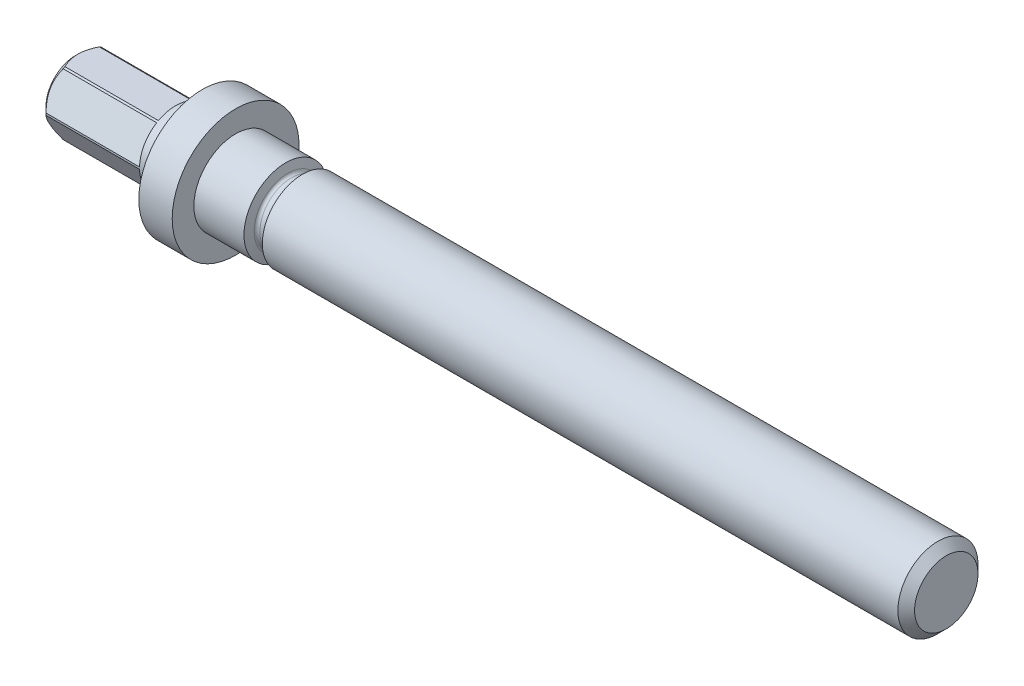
ISO-10303-21;
HEADER;
FILE_DESCRIPTION(('STEP AP214'),'2;1');
FILE_NAME('part.step','',(''),(''),'','','');
FILE_SCHEMA(('AUTOMOTIVE_DESIGN { 1 0 10303 214 1 1 1 1 }'));
ENDSEC;
DATA;
#1=APPLICATION_CONTEXT('core data for automotive mechanical design processes');
#2=APPLICATION_PROTOCOL_DEFINITION('international standard','automotive_design',2000,#1);
#3=PRODUCT_CONTEXT('',#1,'mechanical');
#4=PRODUCT('Part','Part','',(#3));
#5=PRODUCT_RELATED_PRODUCT_CATEGORY('part','',(#4));
#6=PRODUCT_DEFINITION_FORMATION('','',#4);
#7=PRODUCT_DEFINITION_CONTEXT('part definition',#1,'design');
#8=PRODUCT_DEFINITION('design','',#6,#7);
#9=PRODUCT_DEFINITION_SHAPE('','',#8);
#10=(LENGTH_UNIT() NAMED_UNIT(*) SI_UNIT(.MILLI.,.METRE.));
#11=(NAMED_UNIT(*) PLANE_ANGLE_UNIT() SI_UNIT($,.RADIAN.));
#12=(NAMED_UNIT(*) SI_UNIT($,.STERADIAN.) SOLID_ANGLE_UNIT());
#13=UNCERTAINTY_MEASURE_WITH_UNIT(LENGTH_MEASURE(1.E-05),#10,'distance_accuracy_value','');
#14=(GEOMETRIC_REPRESENTATION_CONTEXT(3) GLOBAL_UNCERTAINTY_ASSIGNED_CONTEXT((#13)) GLOBAL_UNIT_ASSIGNED_CONTEXT((#10,
#11,#12)) REPRESENTATION_CONTEXT('',''));
#15=CARTESIAN_POINT('',(0.,0.,0.));
#16=DIRECTION('',(0.,0.,1.));
#17=DIRECTION('',(1.,0.,0.));
#18=AXIS2_PLACEMENT_3D('',#15,#16,#17);
#19=CARTESIAN_POINT('',(-69.1295412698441,0.,0.));
#20=DIRECTION('',(-1.,0.,0.));
#21=DIRECTION('',(0.,0.,1.));
#22=AXIS2_PLACEMENT_3D('',#19,#20,#21);
#23=CYLINDRICAL_SURFACE('',#22,12.5);
#24=CARTESIAN_POINT('',(0.,0.,0.));
#25=DIRECTION('',(-1.,0.,0.));
#26=DIRECTION('',(0.,0.,1.));
#27=AXIS2_PLACEMENT_3D('',#24,#25,#26);
#28=CIRCLE('',#27,12.5);
#29=CARTESIAN_POINT('',(0.,0.,12.5));
#30=VERTEX_POINT('',#29);
#31=EDGE_CURVE('E537',#30,#30,#28,.T.);
#32=ORIENTED_EDGE('',*,*,#31,.F.);
#33=EDGE_LOOP('',(#32));
#34=FACE_BOUND('',#33,.T.);
#35=CARTESIAN_POINT('',(15.,0.,0.));
#36=DIRECTION('',(-1.,0.,0.));
#37=DIRECTION('',(0.,0.,1.));
#38=AXIS2_PLACEMENT_3D('',#35,#36,#37);
#39=CIRCLE('',#38,12.5);
#40=CARTESIAN_POINT('',(15.,0.,12.5));
#41=VERTEX_POINT('',#40);
#42=EDGE_CURVE('E540',#41,#41,#39,.T.);
#43=ORIENTED_EDGE('',*,*,#42,.T.);
#44=EDGE_LOOP('',(#43));
#45=FACE_BOUND('',#44,.T.);
#46=ADVANCED_FACE('F356',(#34,#45),#23,.T.);
#47=CARTESIAN_POINT('',(15.6454411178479,0.,0.));
#48=DIRECTION('',(-1.,0.,0.));
#49=DIRECTION('',(0.,0.,1.));
#50=AXIS2_PLACEMENT_3D('',#47,#48,#49);
#51=CONICAL_SURFACE('',#50,10.0911809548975,1.30899693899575);
#52=ORIENTED_EDGE('',*,*,#42,.F.);
#53=EDGE_LOOP('',(#52));
#54=FACE_BOUND('',#53,.T.);
#55=CARTESIAN_POINT('',(15.6454411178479,0.,0.));
#56=DIRECTION('',(-1.,0.,0.));
#57=DIRECTION('',(0.,0.,1.));
#58=AXIS2_PLACEMENT_3D('',#55,#56,#57);
#59=CIRCLE('',#58,10.0911809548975);
#60=CARTESIAN_POINT('',(15.6454411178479,0.,10.0911809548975));
#61=VERTEX_POINT('',#60);
#62=EDGE_CURVE('E542',#61,#61,#59,.T.);
#63=ORIENTED_EDGE('',*,*,#62,.T.);
#64=EDGE_LOOP('',(#63));
#65=FACE_BOUND('',#64,.T.);
#66=ADVANCED_FACE('F527',(#54,#65),#51,.T.);
#67=CARTESIAN_POINT('',(16.611366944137,0.,0.));
#68=DIRECTION('',(-1.,0.,0.));
#69=DIRECTION('',(0.,0.,1.));
#70=AXIS2_PLACEMENT_3D('',#67,#68,#69);
#71=TOROIDAL_SURFACE('',#70,10.35,0.999999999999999);
#72=ORIENTED_EDGE('',*,*,#62,.F.);
#73=EDGE_LOOP('',(#72));
#74=FACE_BOUND('',#73,.T.);
#75=CARTESIAN_POINT('',(16.611366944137,0.,0.));
#76=DIRECTION('',(-1.,0.,0.));
#77=DIRECTION('',(0.,0.,1.));
#78=AXIS2_PLACEMENT_3D('',#75,#76,#77);
#79=CIRCLE('',#78,9.35000000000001);
#80=CARTESIAN_POINT('',(16.611366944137,0.,9.35));
#81=VERTEX_POINT('',#80);
#82=EDGE_CURVE('E548',#81,#81,#79,.T.);
#83=ORIENTED_EDGE('',*,*,#82,.T.);
#84=EDGE_LOOP('',(#83));
#85=FACE_BOUND('',#84,.T.);
#86=ADVANCED_FACE('F532',(#74,#85),#71,.F.);
#87=CARTESIAN_POINT('',(-69.1295412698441,0.,0.));
#88=DIRECTION('',(-1.,0.,0.));
#89=DIRECTION('',(0.,0.,1.));
#90=AXIS2_PLACEMENT_3D('',#87,#88,#89);
#91=CYLINDRICAL_SURFACE('',#90,9.35000000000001);
#92=ORIENTED_EDGE('',*,*,#82,.F.);
#93=EDGE_LOOP('',(#92));
#94=FACE_BOUND('',#93,.T.);
#95=CARTESIAN_POINT('',(18.5226076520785,0.,0.));
#96=DIRECTION('',(-1.,0.,0.));
#97=DIRECTION('',(0.,0.,1.));
#98=AXIS2_PLACEMENT_3D('',#95,#96,#97);
#99=CIRCLE('',#98,9.35000000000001);
#100=CARTESIAN_POINT('',(18.5226076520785,0.,9.35000000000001));
#101=VERTEX_POINT('',#100);
#102=EDGE_CURVE('E742',#101,#101,#99,.T.);
#103=ORIENTED_EDGE('',*,*,#102,.T.);
#104=EDGE_LOOP('',(#103));
#105=FACE_BOUND('',#104,.T.);
#106=ADVANCED_FACE('F748',(#94,#105),#91,.T.);
#107=CARTESIAN_POINT('',(18.5226076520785,0.,0.));
#108=DIRECTION('',(-1.,0.,0.));
#109=DIRECTION('',(0.,0.,1.));
#110=AXIS2_PLACEMENT_3D('',#107,#108,#109);
#111=TOROIDAL_SURFACE('',#110,10.35,1.);
#112=ORIENTED_EDGE('',*,*,#102,.F.);
#113=EDGE_LOOP('',(#112));
#114=FACE_BOUND('',#113,.T.);
#115=CARTESIAN_POINT('',(19.4885334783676,0.,0.));
#116=DIRECTION('',(-1.,0.,0.));
#117=DIRECTION('',(0.,0.,1.));
#118=AXIS2_PLACEMENT_3D('',#115,#116,#117);
#119=CIRCLE('',#118,10.0911809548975);
#120=CARTESIAN_POINT('',(19.4885334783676,0.,10.0911809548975));
#121=VERTEX_POINT('',#120);
#122=EDGE_CURVE('E739',#121,#121,#119,.T.);
#123=ORIENTED_EDGE('',*,*,#122,.T.);
#124=EDGE_LOOP('',(#123));
#125=FACE_BOUND('',#124,.T.);
#126=ADVANCED_FACE('F751',(#114,#125),#111,.F.);
#127=CARTESIAN_POINT('',(20.,0.,0.));
#128=DIRECTION('',(1.,0.,0.));
#129=DIRECTION('',(0.,0.,-1.));
#130=AXIS2_PLACEMENT_3D('',#127,#128,#129);
#131=CONICAL_SURFACE('',#130,12.,1.30899693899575);
#132=ORIENTED_EDGE('',*,*,#122,.F.);
#133=EDGE_LOOP('',(#132));
#134=FACE_BOUND('',#133,.T.);
#135=CARTESIAN_POINT('',(20.,0.,0.));
#136=DIRECTION('',(-1.,0.,0.));
#137=DIRECTION('',(0.,0.,1.));
#138=AXIS2_PLACEMENT_3D('',#135,#136,#137);
#139=CIRCLE('',#138,12.);
#140=CARTESIAN_POINT('',(20.,0.,12.));
#141=VERTEX_POINT('',#140);
#142=EDGE_CURVE('E736',#141,#141,#139,.T.);
#143=ORIENTED_EDGE('',*,*,#142,.T.);
#144=EDGE_LOOP('',(#143));
#145=FACE_BOUND('',#144,.T.);
#146=ADVANCED_FACE('F757',(#134,#145),#131,.T.);
#147=CARTESIAN_POINT('',(-69.1295412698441,0.,0.));
#148=DIRECTION('',(-1.,0.,0.));
#149=DIRECTION('',(0.,0.,1.));
#150=AXIS2_PLACEMENT_3D('',#147,#148,#149);
#151=CYLINDRICAL_SURFACE('',#150,12.);
#152=CARTESIAN_POINT('',(210.379528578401,0.,0.));
#153=DIRECTION('',(-1.,0.,0.));
#154=DIRECTION('',(0.,0.,1.));
#155=AXIS2_PLACEMENT_3D('',#152,#153,#154);
#156=CIRCLE('',#155,12.);
#157=CARTESIAN_POINT('',(210.379528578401,0.,12.));
#158=VERTEX_POINT('',#157);
#159=EDGE_CURVE('E363',#158,#158,#156,.T.);
#160=ORIENTED_EDGE('',*,*,#159,.T.);
#161=EDGE_LOOP('',(#160));
#162=FACE_BOUND('',#161,.T.);
#163=ORIENTED_EDGE('',*,*,#142,.F.);
#164=EDGE_LOOP('',(#163));
#165=FACE_BOUND('',#164,.T.);
#166=ADVANCED_FACE('F511',(#162,#165),#151,.T.);
#167=CARTESIAN_POINT('',(212.879528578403,12.,0.));
#168=DIRECTION('',(-1.,0.,0.));
#169=DIRECTION('',(0.,0.,1.));
#170=AXIS2_PLACEMENT_3D('',#167,#168,#169);
#171=PLANE('',#170);
#172=CARTESIAN_POINT('',(212.879528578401,0.,0.));
#173=DIRECTION('',(-1.,0.,0.));
#174=DIRECTION('',(0.,0.,1.));
#175=AXIS2_PLACEMENT_3D('',#172,#173,#174);
#176=CIRCLE('',#175,9.5);
#177=CARTESIAN_POINT('',(212.879528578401,0.,9.50000000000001));
#178=VERTEX_POINT('',#177);
#179=EDGE_CURVE('E13',#178,#178,#176,.F.);
#180=ORIENTED_EDGE('',*,*,#179,.T.);
#181=EDGE_LOOP('',(#180));
#182=FACE_BOUND('',#181,.T.);
#183=ADVANCED_FACE('F766',(#182),#171,.F.);
#184=CARTESIAN_POINT('',(-48.,8.79999999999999,0.));
#185=DIRECTION('',(1.,0.,0.));
#186=DIRECTION('',(0.,0.,-1.));
#187=AXIS2_PLACEMENT_3D('',#184,#185,#186);
#188=PLANE('',#187);
#189=CARTESIAN_POINT('',(-48.,0.,0.));
#190=DIRECTION('',(-1.,0.,0.));
#191=DIRECTION('',(0.,0.,1.));
#192=AXIS2_PLACEMENT_3D('',#189,#190,#191);
#193=CIRCLE('',#192,8.8);
#194=CARTESIAN_POINT('',(-48.,0.,8.8));
#195=VERTEX_POINT('',#194);
#196=EDGE_CURVE('E731',#195,#195,#193,.T.);
#197=ORIENTED_EDGE('',*,*,#196,.T.);
#198=EDGE_LOOP('',(#197));
#199=FACE_BOUND('',#198,.T.);
#200=ADVANCED_FACE('F591',(#199),#188,.F.);
#201=CARTESIAN_POINT('',(-46.,0.,0.));
#202=DIRECTION('',(1.,0.,0.));
#203=DIRECTION('',(0.,0.,-1.));
#204=AXIS2_PLACEMENT_3D('',#201,#202,#203);
#205=CONICAL_SURFACE('',#204,10.8,0.785398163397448);
#206=ORIENTED_EDGE('',*,*,#196,.F.);
#207=EDGE_LOOP('',(#206));
#208=FACE_BOUND('',#207,.T.);
#209=CARTESIAN_POINT('',(-46.,0.,0.));
#210=DIRECTION('',(-1.,0.,0.));
#211=DIRECTION('',(0.,0.,1.));
#212=AXIS2_PLACEMENT_3D('',#209,#210,#211);
#213=CIRCLE('',#212,10.8);
#214=CARTESIAN_POINT('',(-46.,9.49999999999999,-5.13711981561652));
#215=VERTEX_POINT('',#214);
#216=CARTESIAN_POINT('',(-46.,9.19887626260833,-5.65868142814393));
#217=VERTEX_POINT('',#216);
#218=EDGE_CURVE('E728',#215,#217,#213,.T.);
#219=ORIENTED_EDGE('',*,*,#218,.T.);
#220=CARTESIAN_POINT('',(-45.9997999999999,9.19924038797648,-5.6584712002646));
#221=CARTESIAN_POINT('',(-46.0848050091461,9.04445456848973,-5.74783683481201));
#222=CARTESIAN_POINT('',(-46.1670279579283,8.88853833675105,-5.83785511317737));
#223=CARTESIAN_POINT('',(-46.325133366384,8.57422752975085,-6.01932254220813));
#224=CARTESIAN_POINT('',(-46.4010127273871,8.41583178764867,-6.11077236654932));
#225=CARTESIAN_POINT('',(-46.6184904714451,7.93540947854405,-6.38814431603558));
#226=CARTESIAN_POINT('',(-46.749159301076,7.60951895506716,-6.5762972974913));
#227=CARTESIAN_POINT('',(-46.9166306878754,7.11591385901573,-6.86128033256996));
#228=CARTESIAN_POINT('',(-46.9674490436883,6.95171193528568,-6.95608235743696));
#229=CARTESIAN_POINT('',(-47.059133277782,6.62124886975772,-7.14687529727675));
#230=CARTESIAN_POINT('',(-47.1000012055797,6.45498815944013,-7.24286596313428));
#231=CARTESIAN_POINT('',(-47.1708518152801,6.12103887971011,-7.43567166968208));
#232=CARTESIAN_POINT('',(-47.2008542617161,5.95335347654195,-7.53248488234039));
#233=CARTESIAN_POINT('',(-47.2493717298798,5.616763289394,-7.72681531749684));
#234=CARTESIAN_POINT('',(-47.267888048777,5.44785864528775,-7.82433245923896));
#235=CARTESIAN_POINT('',(-47.2994329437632,5.0215329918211,-8.07047169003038));
#236=CARTESIAN_POINT('',(-47.3046333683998,4.76364175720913,-8.21936526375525));
#237=CARTESIAN_POINT('',(-47.2870184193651,4.24853003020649,-8.51676515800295));
#238=CARTESIAN_POINT('',(-47.2641937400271,3.99130978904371,-8.6652713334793));
#239=CARTESIAN_POINT('',(-47.1918764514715,3.47951882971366,-8.96075398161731));
#240=CARTESIAN_POINT('',(-47.1423610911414,3.22495056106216,-9.1077290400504));
#241=CARTESIAN_POINT('',(-47.0193143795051,2.72028568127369,-9.39909744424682));
#242=CARTESIAN_POINT('',(-46.9457853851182,2.47018863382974,-9.54349104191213));
#243=CARTESIAN_POINT('',(-46.8058412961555,2.0574315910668,-9.78179643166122));
#244=CARTESIAN_POINT('',(-46.7451544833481,1.89328175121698,-9.87656838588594));
#245=CARTESIAN_POINT('',(-46.6155257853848,1.56746768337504,-10.0646772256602));
#246=CARTESIAN_POINT('',(-46.546584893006,1.40580315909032,-10.1580142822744));
#247=CARTESIAN_POINT('',(-46.40163910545,1.08549588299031,-10.3429437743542));
#248=CARTESIAN_POINT('',(-46.3256581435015,0.926844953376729,-10.4345409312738));
#249=CARTESIAN_POINT('',(-46.1673094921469,0.611992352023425,-10.6163211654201));
#250=CARTESIAN_POINT('',(-46.0849433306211,0.455790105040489,-10.7065045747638));
#251=CARTESIAN_POINT('',(-45.9998,0.300759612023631,-10.7960114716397));
#252=B_SPLINE_CURVE_WITH_KNOTS('',3,(#220,#221,#222,#223,#224,#225,#226,#227,#228,#229,#230,
#231,#232,#233,#234,#235,#236,#237,#238,#239,#240,#241,#242,#243,#244,#245,#246,#247,#248,#249,
#250,#251),.UNSPECIFIED.,.F.,.F.,(4,2,2,2,2,2,2,2,2,2,2,2,2,2,2,4),(0.,0.593676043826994,
1.18764040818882,2.38083809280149,2.96951410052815,3.55806875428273,4.1455473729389,
4.73295963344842,5.62505905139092,6.51745476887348,7.41061236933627,8.30368233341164,
8.90056508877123,9.49737612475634,10.0922279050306,10.686937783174),.UNSPECIFIED.);
#253=CARTESIAN_POINT('',(-46.,0.301123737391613,-10.7958012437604));
#254=VERTEX_POINT('',#253);
#255=EDGE_CURVE('E566',#217,#254,#252,.T.);
#256=ORIENTED_EDGE('',*,*,#255,.T.);
#257=CARTESIAN_POINT('',(-46.,-0.301123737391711,-10.7958012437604));
#258=VERTEX_POINT('',#257);
#259=EDGE_CURVE('E732',#254,#258,#213,.T.);
#260=ORIENTED_EDGE('',*,*,#259,.T.);
#261=CARTESIAN_POINT('',(-45.9998,-0.300759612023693,-10.7960114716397));
#262=CARTESIAN_POINT('',(-46.0848050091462,-0.455545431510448,-10.7066458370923));
#263=CARTESIAN_POINT('',(-46.1670279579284,-0.611461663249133,-10.6166275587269));
#264=CARTESIAN_POINT('',(-46.3251333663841,-0.925772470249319,-10.4351601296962));
#265=CARTESIAN_POINT('',(-46.4010127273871,-1.0841682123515,-10.343710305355));
#266=CARTESIAN_POINT('',(-46.6184904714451,-1.56459052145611,-10.0663383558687));
#267=CARTESIAN_POINT('',(-46.749159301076,-1.89048104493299,-9.87818537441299));
#268=CARTESIAN_POINT('',(-46.9166306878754,-2.38408614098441,-9.59320233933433));
#269=CARTESIAN_POINT('',(-46.9674490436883,-2.54828806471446,-9.49840031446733));
#270=CARTESIAN_POINT('',(-47.059133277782,-2.8787511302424,-9.30760737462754));
#271=CARTESIAN_POINT('',(-47.1000012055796,-3.04501184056,-9.21161670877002));
#272=CARTESIAN_POINT('',(-47.1708518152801,-3.37896112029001,-9.01881100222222));
#273=CARTESIAN_POINT('',(-47.2008542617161,-3.54664652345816,-8.92199778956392));
#274=CARTESIAN_POINT('',(-47.2493717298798,-3.8832367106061,-8.72766735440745));
#275=CARTESIAN_POINT('',(-47.267888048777,-4.05214135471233,-8.63015021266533));
#276=CARTESIAN_POINT('',(-47.2994329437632,-4.47846700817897,-8.38401098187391));
#277=CARTESIAN_POINT('',(-47.3046333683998,-4.73635824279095,-8.23511740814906));
#278=CARTESIAN_POINT('',(-47.2870184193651,-5.25146996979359,-7.93771751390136));
#279=CARTESIAN_POINT('',(-47.264193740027,-5.50869021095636,-7.789211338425));
#280=CARTESIAN_POINT('',(-47.1918764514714,-6.0204811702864,-7.49372869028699));
#281=CARTESIAN_POINT('',(-47.1423610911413,-6.27504943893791,-7.34675363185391));
#282=CARTESIAN_POINT('',(-47.019314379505,-6.77971431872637,-7.05538522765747));
#283=CARTESIAN_POINT('',(-46.9457853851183,-7.02981136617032,-6.91099162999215));
#284=CARTESIAN_POINT('',(-46.8058412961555,-7.44256840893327,-6.67268624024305));
#285=CARTESIAN_POINT('',(-46.7451544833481,-7.60671824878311,-6.57791428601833));
#286=CARTESIAN_POINT('',(-46.6155257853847,-7.93253231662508,-6.38980544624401));
#287=CARTESIAN_POINT('',(-46.5465848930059,-8.09419684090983,-6.2964683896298));
#288=CARTESIAN_POINT('',(-46.4016391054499,-8.41450411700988,-6.11153889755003));
#289=CARTESIAN_POINT('',(-46.3256581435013,-8.57315504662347,-6.01994174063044));
#290=CARTESIAN_POINT('',(-46.1673094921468,-8.88800764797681,-5.83816150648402));
#291=CARTESIAN_POINT('',(-46.084943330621,-9.04420989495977,-5.74797809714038));
#292=CARTESIAN_POINT('',(-45.9997999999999,-9.19924038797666,-5.65847120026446));
#293=B_SPLINE_CURVE_WITH_KNOTS('',3,(#261,#262,#263,#264,#265,#266,#267,#268,#269,#270,#271,
#272,#273,#274,#275,#276,#277,#278,#279,#280,#281,#282,#283,#284,#285,#286,#287,#288,#289,#290,
#291,#292),.UNSPECIFIED.,.F.,.F.,(4,2,2,2,2,2,2,2,2,2,2,2,2,2,2,4),(0.,0.593676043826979,
1.18764040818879,2.38083809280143,2.96951410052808,3.55806875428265,4.1455473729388,
4.7329596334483,5.6250590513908,6.51745476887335,7.41061236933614,8.3036823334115,
8.90056508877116,9.49737612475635,10.0922279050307,10.6869377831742),.UNSPECIFIED.);
#294=CARTESIAN_POINT('',(-46.,-9.19887626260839,-5.65868142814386));
#295=VERTEX_POINT('',#294);
#296=EDGE_CURVE('E606',#258,#295,#293,.T.);
#297=ORIENTED_EDGE('',*,*,#296,.T.);
#298=CARTESIAN_POINT('',(-46.0000000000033,-9.50000000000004,-5.13711981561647));
#299=VERTEX_POINT('',#298);
#300=EDGE_CURVE('E726',#295,#299,#213,.T.);
#301=ORIENTED_EDGE('',*,*,#300,.T.);
#302=CARTESIAN_POINT('',(-42.1910057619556,-9.50000000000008,-11.0983202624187));
#303=CARTESIAN_POINT('',(-42.3957156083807,-9.50000000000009,-10.8287945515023));
#304=CARTESIAN_POINT('',(-42.5984938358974,-9.50000000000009,-10.5577777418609));
#305=CARTESIAN_POINT('',(-42.9993165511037,-9.50000000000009,-10.0121669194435));
#306=CARTESIAN_POINT('',(-43.1973598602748,-9.50000000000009,-9.7375720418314));
#307=CARTESIAN_POINT('',(-43.5892513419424,-9.50000000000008,-9.18220121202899));
#308=CARTESIAN_POINT('',(-43.7830551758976,-9.50000000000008,-8.90139386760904));
#309=CARTESIAN_POINT('',(-44.1635885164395,-9.50000000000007,-8.33504108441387));
#310=CARTESIAN_POINT('',(-44.3503185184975,-9.50000000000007,-8.0494959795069));
#311=CARTESIAN_POINT('',(-44.7259002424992,-9.50000000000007,-7.45585870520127));
#312=CARTESIAN_POINT('',(-44.9142249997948,-9.50000000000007,-7.1474314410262));
#313=CARTESIAN_POINT('',(-45.2787124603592,-9.50000000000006,-6.52336139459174));
#314=CARTESIAN_POINT('',(-45.4548731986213,-9.50000000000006,-6.20771745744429));
#315=CARTESIAN_POINT('',(-45.7912470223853,-9.50000000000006,-5.56920666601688));
#316=CARTESIAN_POINT('',(-45.951506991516,-9.50000000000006,-5.2463647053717));
#317=CARTESIAN_POINT('',(-46.2524904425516,-9.50000000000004,-4.59177159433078));
#318=CARTESIAN_POINT('',(-46.3932228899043,-9.50000000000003,-4.26002461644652));
#319=CARTESIAN_POINT('',(-46.6390078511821,-9.50000000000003,-3.61613356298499));
#320=CARTESIAN_POINT('',(-46.7460928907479,-9.50000000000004,-3.30477340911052));
#321=CARTESIAN_POINT('',(-46.9353046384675,-9.50000000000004,-2.67441754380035));
#322=CARTESIAN_POINT('',(-47.0174296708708,-9.50000000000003,-2.355421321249));
#323=CARTESIAN_POINT('',(-47.1510176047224,-9.50000000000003,-1.71708142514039));
#324=CARTESIAN_POINT('',(-47.2030157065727,-9.50000000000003,-1.39785162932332));
#325=CARTESIAN_POINT('',(-47.2753151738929,-9.50000000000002,-0.75580339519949));
#326=CARTESIAN_POINT('',(-47.2956223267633,-9.5,-0.432985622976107));
#327=CARTESIAN_POINT('',(-47.3029606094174,-9.5,0.200602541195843));
#328=CARTESIAN_POINT('',(-47.2912413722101,-9.50000000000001,0.511358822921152));
#329=CARTESIAN_POINT('',(-47.2379694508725,-9.50000000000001,1.13028664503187));
#330=CARTESIAN_POINT('',(-47.1964139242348,-9.50000000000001,1.43845793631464));
#331=CARTESIAN_POINT('',(-47.0850559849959,-9.5,2.05519865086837));
#332=CARTESIAN_POINT('',(-47.0147672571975,-9.5,2.36367882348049));
#333=CARTESIAN_POINT('',(-46.8497389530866,-9.49999999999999,2.97389695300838));
#334=CARTESIAN_POINT('',(-46.7550012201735,-9.49999999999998,3.27563541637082));
#335=CARTESIAN_POINT('',(-46.5365351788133,-9.49999999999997,3.89613011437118));
#336=CARTESIAN_POINT('',(-46.4110736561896,-9.49999999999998,4.21426965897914));
#337=CARTESIAN_POINT('',(-46.1408454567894,-9.49999999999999,4.84231408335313));
#338=CARTESIAN_POINT('',(-45.9960698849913,-9.49999999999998,5.15221508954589));
#339=CARTESIAN_POINT('',(-45.690653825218,-9.49999999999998,5.76527905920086));
#340=CARTESIAN_POINT('',(-45.5299638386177,-9.49999999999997,6.06841716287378));
#341=CARTESIAN_POINT('',(-45.1962653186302,-9.49999999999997,6.66772795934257));
#342=CARTESIAN_POINT('',(-45.0232587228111,-9.49999999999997,6.96390173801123));
#343=CARTESIAN_POINT('',(-44.6761733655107,-9.49999999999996,7.53565971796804));
#344=CARTESIAN_POINT('',(-44.5025737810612,-9.49999999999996,7.81153634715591));
#345=CARTESIAN_POINT('',(-44.1480422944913,-9.49999999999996,8.35855203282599));
#346=CARTESIAN_POINT('',(-43.9671098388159,-9.49999999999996,8.62969072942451));
#347=CARTESIAN_POINT('',(-43.6007092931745,-9.49999999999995,9.16565816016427));
#348=CARTESIAN_POINT('',(-43.4152897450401,-9.49999999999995,9.43052019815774));
#349=CARTESIAN_POINT('',(-43.0395230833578,-9.49999999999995,9.95661952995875));
#350=CARTESIAN_POINT('',(-42.8491773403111,-9.49999999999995,10.217857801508));
#351=CARTESIAN_POINT('',(-42.656816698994,-9.49999999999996,10.4775776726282));
#352=B_SPLINE_CURVE_WITH_KNOTS('',3,(#302,#303,#304,#305,#306,#307,#308,#309,#310,#311,#312,
#313,#314,#315,#316,#317,#318,#319,#320,#321,#322,#323,#324,#325,#326,#327,#328,#329,#330,#331,
#332,#333,#334,#335,#336,#337,#338,#339,#340,#341,#342,#343,#344,#345,#346,#347,#348,#349,#350,
#351),.UNSPECIFIED.,.F.,.F.,(4,2,2,2,2,2,2,2,2,2,2,2,2,2,2,2,2,2,2,2,2,2,2,2,4),(0.,
1.01537771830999,2.03100558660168,3.05449495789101,4.07791250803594,5.1618215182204,
6.24590521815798,7.32669106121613,8.4069790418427,9.39389765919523,10.3808825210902,
11.3497489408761,12.3184384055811,13.2498758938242,14.1814021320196,15.1293942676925,
16.0773149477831,17.1024739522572,18.1281067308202,19.1570361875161,20.1858041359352,
21.1635241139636,22.1413180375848,23.1112007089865,24.0808163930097),.UNSPECIFIED.);
#353=CARTESIAN_POINT('',(-46.0000000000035,-9.49999999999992,5.13711981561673));
#354=VERTEX_POINT('',#353);
#355=EDGE_CURVE('E570',#299,#354,#352,.T.);
#356=ORIENTED_EDGE('',*,*,#355,.T.);
#357=CARTESIAN_POINT('',(-46.0000000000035,-9.19887626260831,5.65868142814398));
#358=VERTEX_POINT('',#357);
#359=EDGE_CURVE('E724',#354,#358,#213,.T.);
#360=ORIENTED_EDGE('',*,*,#359,.T.);
#361=CARTESIAN_POINT('',(-45.9998000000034,-9.19924038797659,5.65847120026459));
#362=CARTESIAN_POINT('',(-46.0848050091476,-9.04445456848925,5.74783683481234));
#363=CARTESIAN_POINT('',(-46.167027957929,-8.88853833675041,5.8378551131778));
#364=CARTESIAN_POINT('',(-46.325133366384,-8.57422752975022,6.01932254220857));
#365=CARTESIAN_POINT('',(-46.4010127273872,-8.4158317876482,6.11077236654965));
#366=CARTESIAN_POINT('',(-46.6184904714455,-7.93540947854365,6.38814431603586));
#367=CARTESIAN_POINT('',(-46.7491593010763,-7.60951895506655,6.57629729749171));
#368=CARTESIAN_POINT('',(-46.9166306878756,-7.11591385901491,6.86128033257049));
#369=CARTESIAN_POINT('',(-46.9674490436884,-6.95171193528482,6.95608235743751));
#370=CARTESIAN_POINT('',(-47.0591332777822,-6.62124886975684,7.14687529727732));
#371=CARTESIAN_POINT('',(-47.1000012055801,-6.45498815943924,7.24286596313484));
#372=CARTESIAN_POINT('',(-47.1708518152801,-6.12103887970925,7.43567166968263));
#373=CARTESIAN_POINT('',(-47.2008542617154,-5.95335347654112,7.53248488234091));
#374=CARTESIAN_POINT('',(-47.2493717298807,-5.61676328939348,7.72681531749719));
#375=CARTESIAN_POINT('',(-47.26788804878,-5.44785864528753,7.82433245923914));
#376=CARTESIAN_POINT('',(-47.2994329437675,-5.02153299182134,8.07047169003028));
#377=CARTESIAN_POINT('',(-47.3046333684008,-4.7636417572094,8.21936526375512));
#378=CARTESIAN_POINT('',(-47.287018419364,-4.24853003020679,8.5167651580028));
#379=CARTESIAN_POINT('',(-47.2641937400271,-3.99130978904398,8.66527133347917));
#380=CARTESIAN_POINT('',(-47.1918764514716,-3.47951882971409,8.96075398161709));
#381=CARTESIAN_POINT('',(-47.1423610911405,-3.22495056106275,9.10772904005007));
#382=CARTESIAN_POINT('',(-47.0193143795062,-2.72028568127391,9.39909744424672));
#383=CARTESIAN_POINT('',(-46.9457853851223,-2.4701886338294,9.54349104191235));
#384=CARTESIAN_POINT('',(-46.8058412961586,-2.05743159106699,9.78179643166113));
#385=CARTESIAN_POINT('',(-46.7451544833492,-1.89328175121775,9.8765683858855));
#386=CARTESIAN_POINT('',(-46.6155257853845,-1.56746768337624,10.0646772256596));
#387=CARTESIAN_POINT('',(-46.5465848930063,-1.40580315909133,10.1580142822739));
#388=CARTESIAN_POINT('',(-46.4016391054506,-1.08549588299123,10.3429437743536));
#389=CARTESIAN_POINT('',(-46.3256581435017,-0.926844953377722,10.4345409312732));
#390=CARTESIAN_POINT('',(-46.1673094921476,-0.61199235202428,10.6163211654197));
#391=CARTESIAN_POINT('',(-46.0849433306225,-0.455790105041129,10.7065045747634));
#392=CARTESIAN_POINT('',(-45.9998000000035,-0.300759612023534,10.7960114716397));
#393=B_SPLINE_CURVE_WITH_KNOTS('',3,(#361,#362,#363,#364,#365,#366,#367,#368,#369,#370,#371,
#372,#373,#374,#375,#376,#377,#378,#379,#380,#381,#382,#383,#384,#385,#386,#387,#388,#389,#390,
#391,#392),.UNSPECIFIED.,.F.,.F.,(4,2,2,2,2,2,2,2,2,2,2,2,2,2,2,4),(0.,0.59367604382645,
1.18764040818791,2.3808380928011,2.96951410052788,3.55806875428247,4.1455473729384,
4.73295963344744,5.62505905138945,6.51745476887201,7.4106123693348,8.30368233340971,
8.90056508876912,9.49737612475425,10.0922279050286,10.6869377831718),.UNSPECIFIED.);
#394=CARTESIAN_POINT('',(-46.0000000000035,-0.301123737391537,10.7958012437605));
#395=VERTEX_POINT('',#394);
#396=EDGE_CURVE('E612',#358,#395,#393,.T.);
#397=ORIENTED_EDGE('',*,*,#396,.T.);
#398=CARTESIAN_POINT('',(-46.0000000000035,0.301123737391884,10.7958012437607));
#399=VERTEX_POINT('',#398);
#400=EDGE_CURVE('E723',#395,#399,#213,.T.);
#401=ORIENTED_EDGE('',*,*,#400,.T.);
#402=CARTESIAN_POINT('',(-45.9998000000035,0.30075961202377,10.7960114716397));
#403=CARTESIAN_POINT('',(-46.0848050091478,0.45554543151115,10.7066458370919));
#404=CARTESIAN_POINT('',(-46.1670279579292,0.611461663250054,10.6166275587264));
#405=CARTESIAN_POINT('',(-46.3251333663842,0.92577247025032,10.4351601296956));
#406=CARTESIAN_POINT('',(-46.4010127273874,1.08416821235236,10.3437103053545));
#407=CARTESIAN_POINT('',(-46.6184904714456,1.56459052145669,10.0663383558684));
#408=CARTESIAN_POINT('',(-46.7491593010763,1.89048104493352,9.87818537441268));
#409=CARTESIAN_POINT('',(-46.9166306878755,2.38408614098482,9.59320233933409));
#410=CARTESIAN_POINT('',(-46.9674490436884,2.54828806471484,9.4984003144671));
#411=CARTESIAN_POINT('',(-47.0591332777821,2.87875113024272,9.30760737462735));
#412=CARTESIAN_POINT('',(-47.1000012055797,3.04501184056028,9.21161670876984));
#413=CARTESIAN_POINT('',(-47.1708518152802,3.37896112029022,9.01881100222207));
#414=CARTESIAN_POINT('',(-47.2008542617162,3.54664652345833,8.92199778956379));
#415=CARTESIAN_POINT('',(-47.2493717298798,3.8832367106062,8.72766735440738));
#416=CARTESIAN_POINT('',(-47.267888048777,4.0521413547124,8.63015021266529));
#417=CARTESIAN_POINT('',(-47.2994329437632,4.47846700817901,8.3840109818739));
#418=CARTESIAN_POINT('',(-47.3046333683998,4.73635824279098,8.23511740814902));
#419=CARTESIAN_POINT('',(-47.2870184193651,5.25146996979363,7.9377175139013));
#420=CARTESIAN_POINT('',(-47.2641937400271,5.50869021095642,7.78921133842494));
#421=CARTESIAN_POINT('',(-47.1918764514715,6.02048117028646,7.49372869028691));
#422=CARTESIAN_POINT('',(-47.1423610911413,6.27504943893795,7.34675363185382));
#423=CARTESIAN_POINT('',(-47.019314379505,6.77971431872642,7.05538522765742));
#424=CARTESIAN_POINT('',(-46.9457853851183,7.0298113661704,6.91099162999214));
#425=CARTESIAN_POINT('',(-46.8058412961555,7.44256840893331,6.67268624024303));
#426=CARTESIAN_POINT('',(-46.7451544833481,7.60671824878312,6.57791428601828));
#427=CARTESIAN_POINT('',(-46.6155257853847,7.93253231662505,6.38980544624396));
#428=CARTESIAN_POINT('',(-46.546584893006,8.09419684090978,6.29646838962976));
#429=CARTESIAN_POINT('',(-46.40163910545,8.41450411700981,6.11153889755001));
#430=CARTESIAN_POINT('',(-46.3256581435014,8.5731550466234,6.01994174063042));
#431=CARTESIAN_POINT('',(-46.1673094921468,8.88800764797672,5.83816150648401));
#432=CARTESIAN_POINT('',(-46.0849433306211,9.04420989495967,5.74797809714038));
#433=CARTESIAN_POINT('',(-45.9997999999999,9.19924038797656,5.65847120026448));
#434=B_SPLINE_CURVE_WITH_KNOTS('',3,(#402,#403,#404,#405,#406,#407,#408,#409,#410,#411,#412,
#413,#414,#415,#416,#417,#418,#419,#420,#421,#422,#423,#424,#425,#426,#427,#428,#429,#430,#431,
#432,#433),.UNSPECIFIED.,.F.,.F.,(4,2,2,2,2,2,2,2,2,2,2,2,2,2,2,4),(0.,0.593676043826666,
1.18764040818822,2.38083809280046,2.969514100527,3.55806875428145,4.14554737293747,
4.73295963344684,5.62505905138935,6.51745476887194,7.41061236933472,8.30368233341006,
8.90056508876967,9.4973761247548,10.0922279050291,10.6869377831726),.UNSPECIFIED.);
#435=CARTESIAN_POINT('',(-46.,9.19887626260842,5.65868142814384));
#436=VERTEX_POINT('',#435);
#437=EDGE_CURVE('E449',#399,#436,#434,.T.);
#438=ORIENTED_EDGE('',*,*,#437,.T.);
#439=CARTESIAN_POINT('',(-46.,9.50000000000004,5.13711981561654));
#440=VERTEX_POINT('',#439);
#441=EDGE_CURVE('E556',#436,#440,#213,.T.);
#442=ORIENTED_EDGE('',*,*,#441,.T.);
#443=CARTESIAN_POINT('',(-42.28341089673,9.5,-10.9764001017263));
#444=CARTESIAN_POINT('',(-42.4853232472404,9.5,-10.7093048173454));
#445=CARTESIAN_POINT('',(-42.6852949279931,9.5,-10.4407182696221));
#446=CARTESIAN_POINT('',(-43.0804867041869,9.5,-9.89997278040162));
#447=CARTESIAN_POINT('',(-43.2757055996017,9.5,-9.62781296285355));
#448=CARTESIAN_POINT('',(-43.6619098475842,9.5,-9.0773401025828));
#449=CARTESIAN_POINT('',(-43.8528506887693,9.5,-8.79899572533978));
#450=CARTESIAN_POINT('',(-44.2276427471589,9.5,-8.23758888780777));
#451=CARTESIAN_POINT('',(-44.4114944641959,9.5,-7.95452676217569));
#452=CARTESIAN_POINT('',(-44.7808717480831,9.5,-7.36646388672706));
#453=CARTESIAN_POINT('',(-44.9658834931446,9.5,-7.06113874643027));
#454=CARTESIAN_POINT('',(-45.3237878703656,9.5,-6.44335758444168));
#455=CARTESIAN_POINT('',(-45.4966785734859,9.5,-6.13090043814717));
#456=CARTESIAN_POINT('',(-45.8266140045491,9.5,-5.49887575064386));
#457=CARTESIAN_POINT('',(-45.9837053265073,9.5,-5.17933272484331));
#458=CARTESIAN_POINT('',(-46.2785250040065,9.5,-4.53150732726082));
#459=CARTESIAN_POINT('',(-46.41626215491,9.50000000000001,-4.20322900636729));
#460=CARTESIAN_POINT('',(-46.6571752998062,9.50000000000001,-3.56468056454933));
#461=CARTESIAN_POINT('',(-46.7622578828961,9.5,-3.25513728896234));
#462=CARTESIAN_POINT('',(-46.9475948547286,9.5,-2.62856547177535));
#463=CARTESIAN_POINT('',(-47.0278475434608,9.5,-2.31153641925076));
#464=CARTESIAN_POINT('',(-47.1579875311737,9.5,-1.67717709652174));
#465=CARTESIAN_POINT('',(-47.2083973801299,9.5,-1.35995580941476));
#466=CARTESIAN_POINT('',(-47.2778673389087,9.5,-0.722080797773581));
#467=CARTESIAN_POINT('',(-47.2969329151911,9.5,-0.401427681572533));
#468=CARTESIAN_POINT('',(-47.3022825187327,9.5,0.228366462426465));
#469=CARTESIAN_POINT('',(-47.2897445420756,9.5,0.537497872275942));
#470=CARTESIAN_POINT('',(-47.2351872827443,9.5,1.15313097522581));
#471=CARTESIAN_POINT('',(-47.1931651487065,9.5,1.45963241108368));
#472=CARTESIAN_POINT('',(-47.0812236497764,9.5,2.07296987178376));
#473=CARTESIAN_POINT('',(-47.0108282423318,9.5,2.37971760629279));
#474=CARTESIAN_POINT('',(-46.8459056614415,9.5,2.98652467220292));
#475=CARTESIAN_POINT('',(-46.7513804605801,9.5,3.28658454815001));
#476=CARTESIAN_POINT('',(-46.5326772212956,9.5,3.90633931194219));
#477=CARTESIAN_POINT('',(-46.4065897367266,9.5,4.22535346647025));
#478=CARTESIAN_POINT('',(-46.1350465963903,9.5,4.85510249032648));
#479=CARTESIAN_POINT('',(-45.9895819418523,9.5,5.16583343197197));
#480=CARTESIAN_POINT('',(-45.6827443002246,9.5,5.78053021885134));
#481=CARTESIAN_POINT('',(-45.5213214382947,9.5,6.08447096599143));
#482=CARTESIAN_POINT('',(-45.1861339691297,9.5,6.68536058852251));
#483=CARTESIAN_POINT('',(-45.0123713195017,9.5,6.9823105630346));
#484=CARTESIAN_POINT('',(-44.663818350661,9.5,7.55553101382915));
#485=CARTESIAN_POINT('',(-44.4895089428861,9.5,7.83209546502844));
#486=CARTESIAN_POINT('',(-44.1335521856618,9.5,8.38047605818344));
#487=CARTESIAN_POINT('',(-43.9519042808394,9.5,8.65229183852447));
#488=CARTESIAN_POINT('',(-43.5840805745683,9.5,9.18959390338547));
#489=CARTESIAN_POINT('',(-43.3979534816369,9.5,9.45511365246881));
#490=CARTESIAN_POINT('',(-43.0207711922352,9.5,9.98252325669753));
#491=CARTESIAN_POINT('',(-42.8297173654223,9.50000000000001,10.2444140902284));
#492=CARTESIAN_POINT('',(-42.6366490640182,9.50000000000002,10.5047850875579));
#493=B_SPLINE_CURVE_WITH_KNOTS('',3,(#443,#444,#445,#446,#447,#448,#449,#450,#451,#452,#453,
#454,#455,#456,#457,#458,#459,#460,#461,#462,#463,#464,#465,#466,#467,#468,#469,#470,#471,#472,
#473,#474,#475,#476,#477,#478,#479,#480,#481,#482,#483,#484,#485,#486,#487,#488,#489,#490,#491,
#492),.UNSPECIFIED.,.F.,.F.,(4,2,2,2,2,2,2,2,2,2,2,2,2,2,2,2,2,2,2,2,2,2,2,2,4),(0.,
1.00449793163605,2.0092469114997,3.02177938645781,4.03424033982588,5.10503252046,
6.17599473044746,7.24369976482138,8.31091800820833,9.29073841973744,10.270625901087,
11.2328049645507,12.1948162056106,13.1215034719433,14.0482803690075,14.9913007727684,
15.9342441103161,16.9625275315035,17.9912901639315,19.0233762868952,20.0552990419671,
21.0358998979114,22.0165751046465,22.9892917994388,23.9617409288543),.UNSPECIFIED.);
#494=EDGE_CURVE('E563',#440,#215,#493,.F.);
#495=ORIENTED_EDGE('',*,*,#494,.T.);
#496=EDGE_LOOP('',(#219,#256,#260,#297,#301,#356,#360,#397,#401,#438,#442,#495));
#497=FACE_BOUND('',#496,.T.);
#498=ADVANCED_FACE('F586',(#208,#497),#205,.T.);
#499=CARTESIAN_POINT('',(-69.1295412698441,0.,0.));
#500=DIRECTION('',(-1.,0.,0.));
#501=DIRECTION('',(0.,0.,1.));
#502=AXIS2_PLACEMENT_3D('',#499,#500,#501);
#503=CYLINDRICAL_SURFACE('',#502,10.8);
#504=CARTESIAN_POINT('',(-18.,0.,0.));
#505=DIRECTION('',(-1.,0.,0.));
#506=DIRECTION('',(0.,0.,1.));
#507=AXIS2_PLACEMENT_3D('',#504,#505,#506);
#508=CIRCLE('',#507,10.8);
#509=CARTESIAN_POINT('',(-18.,9.19887626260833,-5.65868142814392));
#510=VERTEX_POINT('',#509);
#511=CARTESIAN_POINT('',(-18.,0.30112373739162,-10.7958012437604));
#512=VERTEX_POINT('',#511);
#513=EDGE_CURVE('E468',#510,#512,#508,.T.);
#514=ORIENTED_EDGE('',*,*,#513,.F.);
#515=DIRECTION('',(-1.,0.,0.));
#516=VECTOR('',#515,1.);
#517=CARTESIAN_POINT('',(-69.1295412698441,9.19887626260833,-5.65868142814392));
#518=LINE('',#517,#516);
#519=EDGE_CURVE('E472',#510,#217,#518,.T.);
#520=ORIENTED_EDGE('',*,*,#519,.T.);
#521=ORIENTED_EDGE('',*,*,#218,.F.);
#522=DIRECTION('',(-1.,0.,0.));
#523=VECTOR('',#522,1.);
#524=CARTESIAN_POINT('',(-69.1295412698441,9.50000000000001,-5.13711981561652));
#525=LINE('',#524,#523);
#526=CARTESIAN_POINT('',(-18.,9.49999999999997,-5.13711981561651));
#527=VERTEX_POINT('',#526);
#528=EDGE_CURVE('E541',#215,#527,#525,.F.);
#529=ORIENTED_EDGE('',*,*,#528,.T.);
#530=CARTESIAN_POINT('',(-18.,0.,0.));
#531=DIRECTION('',(-1.,0.,0.));
#532=DIRECTION('',(0.,0.,1.));
#533=AXIS2_PLACEMENT_3D('',#530,#531,#532);
#534=CIRCLE('',#533,10.8);
#535=CARTESIAN_POINT('',(-18.,9.49999999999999,5.13711981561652));
#536=VERTEX_POINT('',#535);
#537=EDGE_CURVE('E545',#536,#527,#534,.T.);
#538=ORIENTED_EDGE('',*,*,#537,.F.);
#539=DIRECTION('',(-1.,0.,0.));
#540=VECTOR('',#539,1.);
#541=CARTESIAN_POINT('',(-69.1295412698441,9.5,5.13711981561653));
#542=LINE('',#541,#540);
#543=EDGE_CURVE('E470',#536,#440,#542,.T.);
#544=ORIENTED_EDGE('',*,*,#543,.T.);
#545=ORIENTED_EDGE('',*,*,#441,.F.);
#546=DIRECTION('',(-1.,0.,0.));
#547=VECTOR('',#546,1.);
#548=CARTESIAN_POINT('',(-69.1295412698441,9.19887626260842,5.6586814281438));
#549=LINE('',#548,#547);
#550=CARTESIAN_POINT('',(-18.,9.19887626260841,5.6586814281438));
#551=VERTEX_POINT('',#550);
#552=EDGE_CURVE('E466',#436,#551,#549,.F.);
#553=ORIENTED_EDGE('',*,*,#552,.T.);
#554=CARTESIAN_POINT('',(-18.0000000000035,0.301123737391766,10.7958012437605));
#555=VERTEX_POINT('',#554);
#556=EDGE_CURVE('E455',#555,#551,#508,.T.);
#557=ORIENTED_EDGE('',*,*,#556,.F.);
#558=DIRECTION('',(-1.,0.,0.));
#559=VECTOR('',#558,1.);
#560=CARTESIAN_POINT('',(-69.1295412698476,0.301123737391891,10.7958012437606));
#561=LINE('',#560,#559);
#562=EDGE_CURVE('E443',#555,#399,#561,.T.);
#563=ORIENTED_EDGE('',*,*,#562,.T.);
#564=ORIENTED_EDGE('',*,*,#400,.F.);
#565=DIRECTION('',(-1.,0.,0.));
#566=VECTOR('',#565,1.);
#567=CARTESIAN_POINT('',(-69.1295412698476,-0.301123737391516,10.7958012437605));
#568=LINE('',#567,#566);
#569=CARTESIAN_POINT('',(-18.0000000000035,-0.301123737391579,10.7958012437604));
#570=VERTEX_POINT('',#569);
#571=EDGE_CURVE('E483',#395,#570,#568,.F.);
#572=ORIENTED_EDGE('',*,*,#571,.T.);
#573=CARTESIAN_POINT('',(-18.0000000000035,-9.19887626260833,5.65868142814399));
#574=VERTEX_POINT('',#573);
#575=EDGE_CURVE('E477',#574,#570,#508,.T.);
#576=ORIENTED_EDGE('',*,*,#575,.F.);
#577=DIRECTION('',(-1.,0.,0.));
#578=VECTOR('',#577,1.);
#579=CARTESIAN_POINT('',(-69.1295412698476,-9.1988762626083,5.658681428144));
#580=LINE('',#579,#578);
#581=EDGE_CURVE('E487',#574,#358,#580,.T.);
#582=ORIENTED_EDGE('',*,*,#581,.T.);
#583=ORIENTED_EDGE('',*,*,#359,.F.);
#584=DIRECTION('',(-1.,0.,0.));
#585=VECTOR('',#584,1.);
#586=CARTESIAN_POINT('',(-69.1295412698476,-9.49999999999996,5.13711981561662));
#587=LINE('',#586,#585);
#588=CARTESIAN_POINT('',(-18.0000000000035,-9.49999999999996,5.13711981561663));
#589=VERTEX_POINT('',#588);
#590=EDGE_CURVE('E493',#354,#589,#587,.F.);
#591=ORIENTED_EDGE('',*,*,#590,.T.);
#592=CARTESIAN_POINT('',(-18.0000000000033,-9.50000000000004,-5.13711981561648));
#593=VERTEX_POINT('',#592);
#594=EDGE_CURVE('E474',#593,#589,#508,.T.);
#595=ORIENTED_EDGE('',*,*,#594,.F.);
#596=DIRECTION('',(-1.,0.,0.));
#597=VECTOR('',#596,1.);
#598=CARTESIAN_POINT('',(-69.1295412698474,-9.50000000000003,-5.13711981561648));
#599=LINE('',#598,#597);
#600=EDGE_CURVE('E496',#593,#299,#599,.T.);
#601=ORIENTED_EDGE('',*,*,#600,.T.);
#602=ORIENTED_EDGE('',*,*,#300,.F.);
#603=DIRECTION('',(-1.,0.,0.));
#604=VECTOR('',#603,1.);
#605=CARTESIAN_POINT('',(-69.1295412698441,-9.19887626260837,-5.65868142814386));
#606=LINE('',#605,#604);
#607=CARTESIAN_POINT('',(-18.,-9.1988762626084,-5.65868142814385));
#608=VERTEX_POINT('',#607);
#609=EDGE_CURVE('E454',#295,#608,#606,.F.);
#610=ORIENTED_EDGE('',*,*,#609,.T.);
#611=CARTESIAN_POINT('',(-18.,-0.301123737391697,-10.7958012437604));
#612=VERTEX_POINT('',#611);
#613=EDGE_CURVE('E469',#612,#608,#508,.T.);
#614=ORIENTED_EDGE('',*,*,#613,.F.);
#615=DIRECTION('',(-1.,0.,0.));
#616=VECTOR('',#615,1.);
#617=CARTESIAN_POINT('',(-69.1295412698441,-0.301123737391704,-10.7958012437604));
#618=LINE('',#617,#616);
#619=EDGE_CURVE('E476',#612,#258,#618,.T.);
#620=ORIENTED_EDGE('',*,*,#619,.T.);
#621=ORIENTED_EDGE('',*,*,#259,.F.);
#622=DIRECTION('',(-1.,0.,0.));
#623=VECTOR('',#622,1.);
#624=CARTESIAN_POINT('',(-69.1295412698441,0.301123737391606,-10.7958012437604));
#625=LINE('',#624,#623);
#626=EDGE_CURVE('E473',#254,#512,#625,.F.);
#627=ORIENTED_EDGE('',*,*,#626,.T.);
#628=EDGE_LOOP('',(#514,#520,#521,#529,#538,#544,#545,#553,#557,#563,#564,#572,#576,#582,#583,
#591,#595,#601,#602,#610,#614,#620,#621,#627));
#629=FACE_BOUND('',#628,.T.);
#630=CARTESIAN_POINT('',(-10.,0.,0.));
#631=DIRECTION('',(-1.,0.,0.));
#632=DIRECTION('',(0.,0.,1.));
#633=AXIS2_PLACEMENT_3D('',#630,#631,#632);
#634=CIRCLE('',#633,10.8);
#635=CARTESIAN_POINT('',(-10.,0.,10.8));
#636=VERTEX_POINT('',#635);
#637=EDGE_CURVE('E727',#636,#636,#634,.T.);
#638=ORIENTED_EDGE('',*,*,#637,.T.);
#639=EDGE_LOOP('',(#638));
#640=FACE_BOUND('',#639,.T.);
#641=ADVANCED_FACE('F463',(#629,#640),#503,.T.);
#642=CARTESIAN_POINT('',(-10.,19.,0.));
#643=DIRECTION('',(1.,0.,0.));
#644=DIRECTION('',(0.,0.,-1.));
#645=AXIS2_PLACEMENT_3D('',#642,#643,#644);
#646=PLANE('',#645);
#647=ORIENTED_EDGE('',*,*,#637,.F.);
#648=EDGE_LOOP('',(#647));
#649=FACE_BOUND('',#648,.T.);
#650=CARTESIAN_POINT('',(-10.,0.,0.));
#651=DIRECTION('',(-1.,0.,0.));
#652=DIRECTION('',(0.,0.,1.));
#653=AXIS2_PLACEMENT_3D('',#650,#651,#652);
#654=CIRCLE('',#653,19.);
#655=CARTESIAN_POINT('',(-10.,0.,19.));
#656=VERTEX_POINT('',#655);
#657=EDGE_CURVE('E840',#656,#656,#654,.T.);
#658=ORIENTED_EDGE('',*,*,#657,.T.);
#659=EDGE_LOOP('',(#658));
#660=FACE_BOUND('',#659,.T.);
#661=ADVANCED_FACE('F801',(#649,#660),#646,.F.);
#662=CARTESIAN_POINT('',(-69.1295412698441,0.,0.));
#663=DIRECTION('',(-1.,0.,0.));
#664=DIRECTION('',(0.,0.,1.));
#665=AXIS2_PLACEMENT_3D('',#662,#663,#664);
#666=CYLINDRICAL_SURFACE('',#665,19.);
#667=ORIENTED_EDGE('',*,*,#657,.F.);
#668=EDGE_LOOP('',(#667));
#669=FACE_BOUND('',#668,.T.);
#670=CARTESIAN_POINT('',(0.,0.,0.));
#671=DIRECTION('',(-1.,0.,0.));
#672=DIRECTION('',(0.,0.,1.));
#673=AXIS2_PLACEMENT_3D('',#670,#671,#672);
#674=CIRCLE('',#673,19.);
#675=CARTESIAN_POINT('',(0.,0.,19.));
#676=VERTEX_POINT('',#675);
#677=EDGE_CURVE('E839',#676,#676,#674,.T.);
#678=ORIENTED_EDGE('',*,*,#677,.T.);
#679=EDGE_LOOP('',(#678));
#680=FACE_BOUND('',#679,.T.);
#681=ADVANCED_FACE('F805',(#669,#680),#666,.T.);
#682=CARTESIAN_POINT('',(0.,12.5,0.));
#683=DIRECTION('',(-1.,0.,0.));
#684=DIRECTION('',(0.,0.,1.));
#685=AXIS2_PLACEMENT_3D('',#682,#683,#684);
#686=PLANE('',#685);
#687=ORIENTED_EDGE('',*,*,#677,.F.);
#688=EDGE_LOOP('',(#687));
#689=FACE_BOUND('',#688,.T.);
#690=ORIENTED_EDGE('',*,*,#31,.T.);
#691=EDGE_LOOP('',(#690));
#692=FACE_BOUND('',#691,.T.);
#693=ADVANCED_FACE('F810',(#689,#692),#686,.F.);
#694=CARTESIAN_POINT('',(-18.,13.5,-19.2168674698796));
#695=DIRECTION('',(-1.,0.,0.));
#696=DIRECTION('',(0.,0.,1.));
#697=AXIS2_PLACEMENT_3D('',#694,#695,#696);
#698=PLANE('',#697);
#699=ORIENTED_EDGE('',*,*,#537,.T.);
#700=DIRECTION('',(0.,0.,-1.));
#701=VECTOR('',#700,1.);
#702=CARTESIAN_POINT('',(-18.,9.50000000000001,-19.2168674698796));
#703=LINE('',#702,#701);
#704=EDGE_CURVE('E561',#536,#527,#703,.T.);
#705=ORIENTED_EDGE('',*,*,#704,.F.);
#706=EDGE_LOOP('',(#699,#705));
#707=FACE_BOUND('',#706,.T.);
#708=ADVANCED_FACE('F565',(#707),#698,.T.);
#709=CARTESIAN_POINT('',(-18.0000000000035,9.5,21.1579651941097));
#710=DIRECTION('',(0.,-1.,0.));
#711=DIRECTION('',(0.,0.,-1.));
#712=AXIS2_PLACEMENT_3D('',#709,#710,#711);
#713=PLANE('',#712);
#714=ORIENTED_EDGE('',*,*,#704,.T.);
#715=ORIENTED_EDGE('',*,*,#528,.F.);
#716=ORIENTED_EDGE('',*,*,#494,.F.);
#717=ORIENTED_EDGE('',*,*,#543,.F.);
#718=EDGE_LOOP('',(#714,#715,#716,#717));
#719=FACE_BOUND('',#718,.T.);
#720=ADVANCED_FACE('F560',(#719),#713,.F.);
#721=CARTESIAN_POINT('',(-18.0000000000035,-13.5733353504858,18.8062239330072));
#722=DIRECTION('',(0.,-0.500000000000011,-0.866025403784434));
#723=DIRECTION('',(0.,0.866025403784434,-0.500000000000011));
#724=AXIS2_PLACEMENT_3D('',#721,#722,#723);
#725=PLANE('',#724);
#726=DIRECTION('',(0.,0.866025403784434,-0.500000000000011));
#727=VECTOR('',#726,1.);
#728=CARTESIAN_POINT('',(-18.,21.3922954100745,-1.38119239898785));
#729=LINE('',#728,#727);
#730=EDGE_CURVE('E446',#555,#551,#729,.T.);
#731=ORIENTED_EDGE('',*,*,#730,.T.);
#732=ORIENTED_EDGE('',*,*,#552,.F.);
#733=ORIENTED_EDGE('',*,*,#437,.F.);
#734=ORIENTED_EDGE('',*,*,#562,.F.);
#735=EDGE_LOOP('',(#731,#732,#733,#734));
#736=FACE_BOUND('',#735,.T.);
#737=ADVANCED_FACE('F445',(#736),#725,.F.);
#738=CARTESIAN_POINT('',(-18.,-9.89229541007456,-21.2997766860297));
#739=DIRECTION('',(-1.,0.,0.));
#740=DIRECTION('',(0.,0.,1.));
#741=AXIS2_PLACEMENT_3D('',#738,#739,#740);
#742=PLANE('',#741);
#743=ORIENTED_EDGE('',*,*,#556,.T.);
#744=ORIENTED_EDGE('',*,*,#730,.F.);
#745=EDGE_LOOP('',(#743,#744));
#746=FACE_BOUND('',#745,.T.);
#747=ADVANCED_FACE('F458',(#746),#742,.T.);
#748=CARTESIAN_POINT('',(-18.,13.5733353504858,-18.8062239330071));
#749=DIRECTION('',(0.,0.500000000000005,0.866025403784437));
#750=DIRECTION('',(0.,-0.866025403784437,0.500000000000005));
#751=AXIS2_PLACEMENT_3D('',#748,#749,#750);
#752=PLANE('',#751);
#753=DIRECTION('',(0.,-0.866025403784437,0.500000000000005));
#754=VECTOR('',#753,1.);
#755=CARTESIAN_POINT('',(-18.0000000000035,-21.3922954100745,1.38119239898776));
#756=LINE('',#755,#754);
#757=EDGE_CURVE('E713',#612,#608,#756,.T.);
#758=ORIENTED_EDGE('',*,*,#757,.T.);
#759=ORIENTED_EDGE('',*,*,#609,.F.);
#760=ORIENTED_EDGE('',*,*,#296,.F.);
#761=ORIENTED_EDGE('',*,*,#619,.F.);
#762=EDGE_LOOP('',(#758,#759,#760,#761));
#763=FACE_BOUND('',#762,.T.);
#764=ADVANCED_FACE('F629',(#763),#752,.F.);
#765=ORIENTED_EDGE('',*,*,#613,.T.);
#766=ORIENTED_EDGE('',*,*,#757,.F.);
#767=EDGE_LOOP('',(#765,#766));
#768=FACE_BOUND('',#767,.T.);
#769=ADVANCED_FACE('F632',(#768),#742,.T.);
#770=CARTESIAN_POINT('',(-18.0000000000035,-23.073335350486,-2.35174126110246));
#771=DIRECTION('',(0.,0.499999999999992,-0.866025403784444));
#772=DIRECTION('',(0.,0.866025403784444,0.499999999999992));
#773=AXIS2_PLACEMENT_3D('',#770,#771,#772);
#774=PLANE('',#773);
#775=DIRECTION('',(0.,0.866025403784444,0.499999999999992));
#776=VECTOR('',#775,1.);
#777=CARTESIAN_POINT('',(-18.,11.8922954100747,17.8356750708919));
#778=LINE('',#777,#776);
#779=EDGE_CURVE('E460',#574,#570,#778,.T.);
#780=ORIENTED_EDGE('',*,*,#779,.T.);
#781=ORIENTED_EDGE('',*,*,#571,.F.);
#782=ORIENTED_EDGE('',*,*,#396,.F.);
#783=ORIENTED_EDGE('',*,*,#581,.F.);
#784=EDGE_LOOP('',(#780,#781,#782,#783));
#785=FACE_BOUND('',#784,.T.);
#786=ADVANCED_FACE('F627',(#785),#774,.F.);
#787=ORIENTED_EDGE('',*,*,#575,.T.);
#788=ORIENTED_EDGE('',*,*,#779,.F.);
#789=EDGE_LOOP('',(#787,#788));
#790=FACE_BOUND('',#789,.T.);
#791=ADVANCED_FACE('F626',(#790),#742,.T.);
#792=CARTESIAN_POINT('',(-18.,-9.50000000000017,-21.1579651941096));
#793=DIRECTION('',(0.,1.,0.));
#794=DIRECTION('',(0.,0.,1.));
#795=AXIS2_PLACEMENT_3D('',#792,#793,#794);
#796=PLANE('',#795);
#797=DIRECTION('',(0.,0.,1.));
#798=VECTOR('',#797,1.);
#799=CARTESIAN_POINT('',(-18.0000000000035,-9.49999999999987,19.2168674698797));
#800=LINE('',#799,#798);
#801=EDGE_CURVE('E378',#593,#589,#800,.T.);
#802=ORIENTED_EDGE('',*,*,#801,.T.);
#803=ORIENTED_EDGE('',*,*,#590,.F.);
#804=ORIENTED_EDGE('',*,*,#355,.F.);
#805=ORIENTED_EDGE('',*,*,#600,.F.);
#806=EDGE_LOOP('',(#802,#803,#804,#805));
#807=FACE_BOUND('',#806,.T.);
#808=ADVANCED_FACE('F622',(#807),#796,.F.);
#809=ORIENTED_EDGE('',*,*,#594,.T.);
#810=ORIENTED_EDGE('',*,*,#801,.F.);
#811=EDGE_LOOP('',(#809,#810));
#812=FACE_BOUND('',#811,.T.);
#813=ADVANCED_FACE('F625',(#812),#742,.T.);
#814=ORIENTED_EDGE('',*,*,#513,.T.);
#815=DIRECTION('',(0.,-0.866025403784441,-0.499999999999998));
#816=VECTOR('',#815,1.);
#817=CARTESIAN_POINT('',(-18.,-11.8922954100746,-17.8356750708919));
#818=LINE('',#817,#816);
#819=EDGE_CURVE('E370',#510,#512,#818,.T.);
#820=ORIENTED_EDGE('',*,*,#819,.F.);
#821=EDGE_LOOP('',(#814,#820));
#822=FACE_BOUND('',#821,.T.);
#823=ADVANCED_FACE('F522',(#822),#742,.T.);
#824=CARTESIAN_POINT('',(-18.,23.0733353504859,2.35174126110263));
#825=DIRECTION('',(0.,-0.499999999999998,0.866025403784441));
#826=DIRECTION('',(0.,-0.866025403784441,-0.499999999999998));
#827=AXIS2_PLACEMENT_3D('',#824,#825,#826);
#828=PLANE('',#827);
#829=ORIENTED_EDGE('',*,*,#819,.T.);
#830=ORIENTED_EDGE('',*,*,#626,.F.);
#831=ORIENTED_EDGE('',*,*,#255,.F.);
#832=ORIENTED_EDGE('',*,*,#519,.F.);
#833=EDGE_LOOP('',(#829,#830,#831,#832));
#834=FACE_BOUND('',#833,.T.);
#835=ADVANCED_FACE('F516',(#834),#828,.F.);
#836=CARTESIAN_POINT('',(210.379528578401,0.,0.));
#837=DIRECTION('',(-1.,0.,0.));
#838=DIRECTION('',(0.,0.,1.));
#839=AXIS2_PLACEMENT_3D('',#836,#837,#838);
#840=CONICAL_SURFACE('',#839,12.,0.785398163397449);
#841=ORIENTED_EDGE('',*,*,#179,.F.);
#842=EDGE_LOOP('',(#841));
#843=FACE_BOUND('',#842,.T.);
#844=ORIENTED_EDGE('',*,*,#159,.F.);
#845=EDGE_LOOP('',(#844));
#846=FACE_BOUND('',#845,.T.);
#847=ADVANCED_FACE('F514',(#843,#846),#840,.T.);
#848=CLOSED_SHELL('',(#46,#66,#86,#106,#126,#146,#166,#183,#200,#498,#641,#661,#681,#693,#708,
#720,#737,#747,#764,#769,#786,#791,#808,#813,#823,#835,#847));
#849=MANIFOLD_SOLID_BREP('B2',#848);
#850=ADVANCED_BREP_SHAPE_REPRESENTATION('',(#18,#849),#14);
#851=SHAPE_DEFINITION_REPRESENTATION(#9,#850);
ENDSEC;
END-ISO-10303-21;
